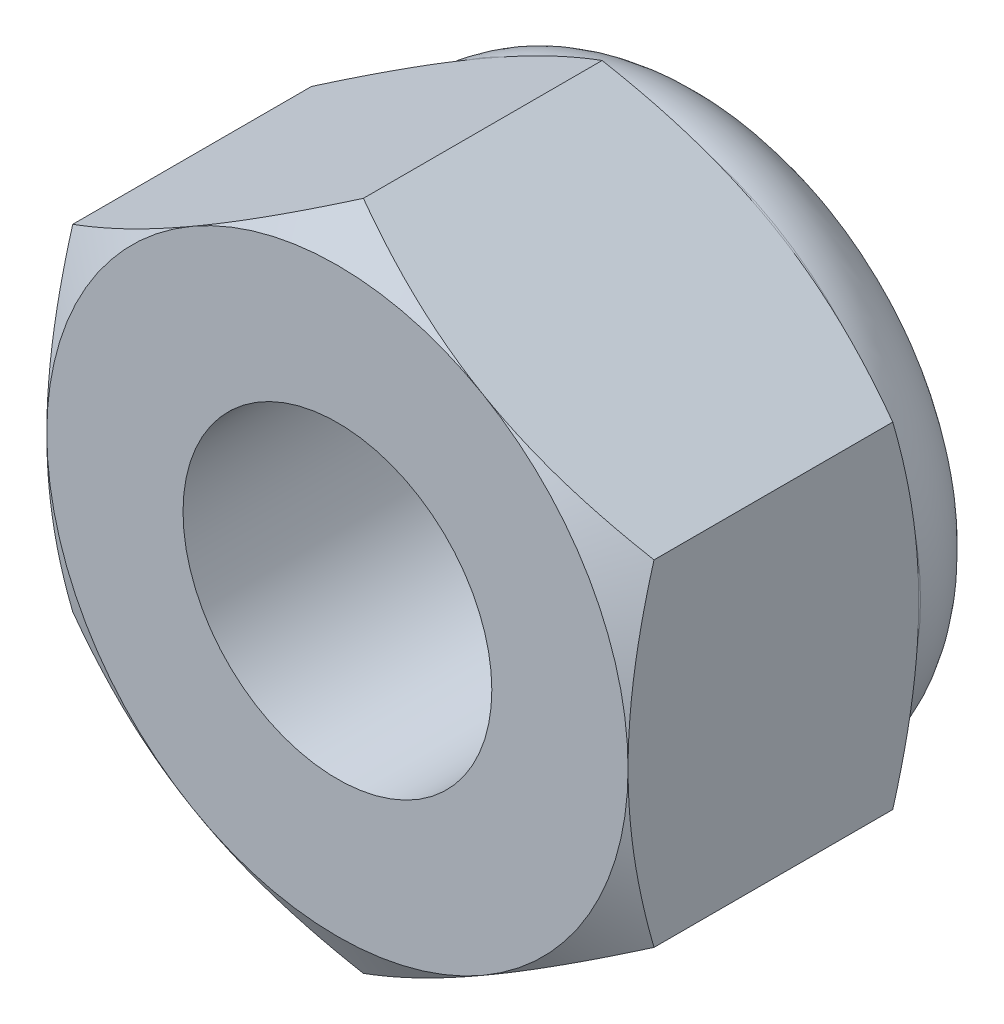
from build123d import *

# Parameters (mm, degrees)
BASE_EXTRUSION_DEPTH   = 8
TROU_TARAUD_M10X1_51_D = 8.5


with BuildPart() as part:
    # Esquisse1 → Base-Extrusion (new body)
    with BuildSketch(Plane.XY):
        Polygon((8, -4.618802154), (8, 4.618802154), (0, 9.237604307), (-8, 4.618802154), (-8, -4.618802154), (0, -9.237604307), align=None)
    extrude(amount=-BASE_EXTRUSION_DEPTH)

    # Esquisse2 → Enl_vement de mati_re-R_volution1 (revolve, cut)
    with BuildSketch(Plane(origin=(0, 0, 0), x_dir=(1, 0, 0), z_dir=(0, 1, 0)), mode=Mode.PRIVATE) as enl_vement_de_mati_re_r_volution1_sk:
        Polygon((-8, 0), (-15.92820323, 0), (-15.92820323, 8), (-8, 8), (-14.92820323, 4), align=None)
    revolve(enl_vement_de_mati_re_r_volution1_sk.sketch.rotate(Axis((0, 0, -8), (0, 0, 1)), 180), axis=Axis((0, 0, -8), (0, 0, 1)), mode=Mode.SUBTRACT)

    # Esquisse4 → Boss.-R_vol.1 (revolve)
    with BuildSketch(Plane(origin=(0, 0, 0), x_dir=(1, 0, 0), z_dir=(0, 1, 0)), mode=Mode.PRIVATE) as boss_r_vol_1_sk:
        with BuildLine():
            Line((-5.55, 10.5), (0, 10.5))
            Line((0, 10.5), (0, 8))
            Line((0, 8), (-8, 8))
            Line((-8, 8), (-8, 8.05))
            ThreePointArc((-8, 8.05), (-7.282411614, 9.782411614), (-5.55, 10.5))
        make_face()
    revolve(boss_r_vol_1_sk.sketch.rotate(Axis((0, 0, 0), (0, 0, -1)), 180), axis=Axis((0, 0, 0), (0, 0, -1)))

    # Trou taraud_ M10x1.51 (through all)
    with Locations(Plane.XY):
        with Locations((0, 0)):
            Hole(TROU_TARAUD_M10X1_51_D / 2)


solid = part.part
